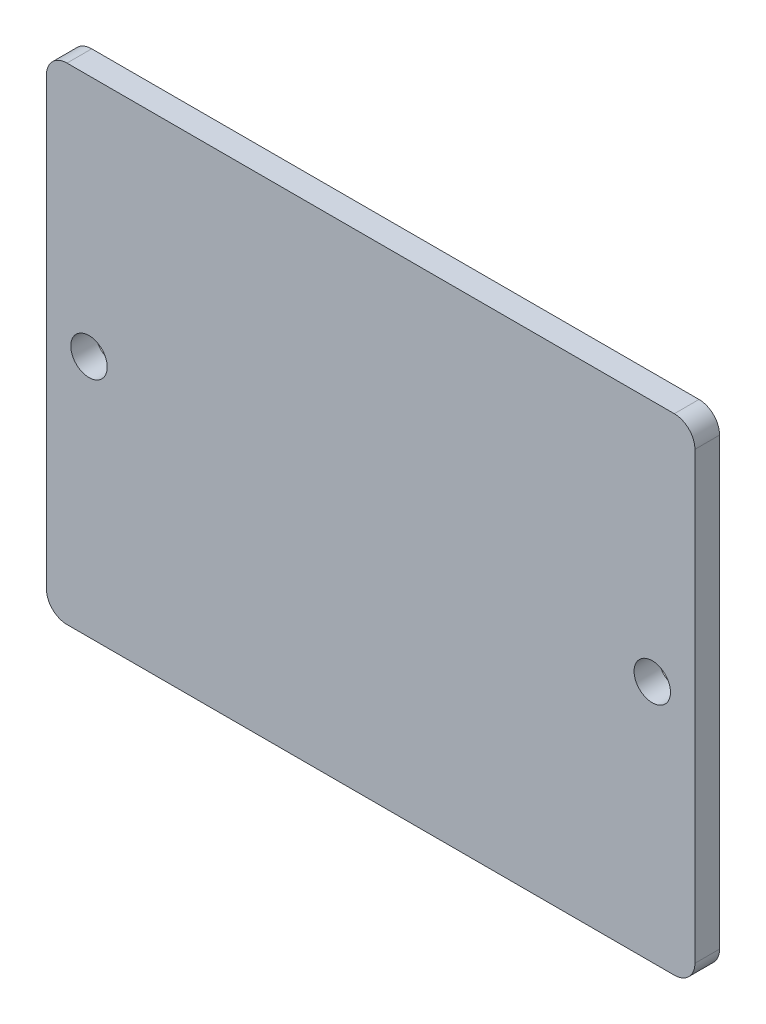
ISO-10303-21;
HEADER;
FILE_DESCRIPTION(('STEP AP214'),'2;1');
FILE_NAME('part.step','',(''),(''),'','','');
FILE_SCHEMA(('AUTOMOTIVE_DESIGN { 1 0 10303 214 1 1 1 1 }'));
ENDSEC;
DATA;
#1=APPLICATION_CONTEXT('core data for automotive mechanical design processes');
#2=APPLICATION_PROTOCOL_DEFINITION('international standard','automotive_design',2000,#1);
#3=PRODUCT_CONTEXT('',#1,'mechanical');
#4=PRODUCT('Part','Part','',(#3));
#5=PRODUCT_RELATED_PRODUCT_CATEGORY('part','',(#4));
#6=PRODUCT_DEFINITION_FORMATION('','',#4);
#7=PRODUCT_DEFINITION_CONTEXT('part definition',#1,'design');
#8=PRODUCT_DEFINITION('design','',#6,#7);
#9=PRODUCT_DEFINITION_SHAPE('','',#8);
#10=(LENGTH_UNIT() NAMED_UNIT(*) SI_UNIT(.MILLI.,.METRE.));
#11=(NAMED_UNIT(*) PLANE_ANGLE_UNIT() SI_UNIT($,.RADIAN.));
#12=(NAMED_UNIT(*) SI_UNIT($,.STERADIAN.) SOLID_ANGLE_UNIT());
#13=UNCERTAINTY_MEASURE_WITH_UNIT(LENGTH_MEASURE(1.E-05),#10,'distance_accuracy_value','');
#14=(GEOMETRIC_REPRESENTATION_CONTEXT(3) GLOBAL_UNCERTAINTY_ASSIGNED_CONTEXT((#13)) GLOBAL_UNIT_ASSIGNED_CONTEXT((#10,
#11,#12)) REPRESENTATION_CONTEXT('',''));
#15=CARTESIAN_POINT('',(0.,0.,0.));
#16=DIRECTION('',(0.,0.,1.));
#17=DIRECTION('',(1.,0.,0.));
#18=AXIS2_PLACEMENT_3D('',#15,#16,#17);
#19=CARTESIAN_POINT('',(-37.465,27.4573999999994,3.04800000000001));
#20=DIRECTION('',(0.,0.,-1.));
#21=DIRECTION('',(-1.,0.,0.));
#22=AXIS2_PLACEMENT_3D('',#19,#20,#21);
#23=CYLINDRICAL_SURFACE('',#22,2.54);
#24=CARTESIAN_POINT('',(-37.465,27.4573999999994,0.));
#25=DIRECTION('',(0.,0.,1.));
#26=DIRECTION('',(-1.,0.,0.));
#27=AXIS2_PLACEMENT_3D('',#24,#25,#26);
#28=CIRCLE('',#27,2.54);
#29=CARTESIAN_POINT('',(-37.465,29.9973999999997,0.));
#30=VERTEX_POINT('',#29);
#31=CARTESIAN_POINT('',(-40.005,27.4574,0.));
#32=VERTEX_POINT('',#31);
#33=EDGE_CURVE('E100',#30,#32,#28,.T.);
#34=ORIENTED_EDGE('',*,*,#33,.T.);
#35=DIRECTION('',(0.,0.,-1.));
#36=VECTOR('',#35,1.);
#37=CARTESIAN_POINT('',(-40.005,27.4574,3.048));
#38=LINE('',#37,#36);
#39=CARTESIAN_POINT('',(-40.005,27.4574,3.048));
#40=VERTEX_POINT('',#39);
#41=EDGE_CURVE('E11',#40,#32,#38,.T.);
#42=ORIENTED_EDGE('',*,*,#41,.F.);
#43=CARTESIAN_POINT('',(-37.465,27.4573999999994,3.04800000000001));
#44=DIRECTION('',(0.,0.,1.));
#45=DIRECTION('',(-1.,0.,0.));
#46=AXIS2_PLACEMENT_3D('',#43,#44,#45);
#47=CIRCLE('',#46,2.54);
#48=CARTESIAN_POINT('',(-37.465,29.9973999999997,3.048));
#49=VERTEX_POINT('',#48);
#50=EDGE_CURVE('E132',#49,#40,#47,.T.);
#51=ORIENTED_EDGE('',*,*,#50,.F.);
#52=DIRECTION('',(0.,0.,-1.));
#53=VECTOR('',#52,1.);
#54=CARTESIAN_POINT('',(-37.465,29.9973999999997,3.048));
#55=LINE('',#54,#53);
#56=EDGE_CURVE('E113',#49,#30,#55,.T.);
#57=ORIENTED_EDGE('',*,*,#56,.T.);
#58=EDGE_LOOP('',(#34,#42,#51,#57));
#59=FACE_BOUND('',#58,.T.);
#60=ADVANCED_FACE('F32',(#59),#23,.T.);
#61=CARTESIAN_POINT('',(-40.005,27.4574,3.048));
#62=DIRECTION('',(1.,0.,0.));
#63=DIRECTION('',(0.,1.,0.));
#64=AXIS2_PLACEMENT_3D('',#61,#62,#63);
#65=PLANE('',#64);
#66=DIRECTION('',(0.,-1.,0.));
#67=VECTOR('',#66,1.);
#68=CARTESIAN_POINT('',(-40.005,27.4574,0.));
#69=LINE('',#68,#67);
#70=CARTESIAN_POINT('',(-40.005,-27.4574,0.));
#71=VERTEX_POINT('',#70);
#72=EDGE_CURVE('E96',#32,#71,#69,.T.);
#73=ORIENTED_EDGE('',*,*,#72,.T.);
#74=DIRECTION('',(0.,0.,-1.));
#75=VECTOR('',#74,1.);
#76=CARTESIAN_POINT('',(-40.005,-27.4574,3.04799999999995));
#77=LINE('',#76,#75);
#78=CARTESIAN_POINT('',(-40.005,-27.4574,3.04799999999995));
#79=VERTEX_POINT('',#78);
#80=EDGE_CURVE('E39',#79,#71,#77,.T.);
#81=ORIENTED_EDGE('',*,*,#80,.F.);
#82=DIRECTION('',(0.,-1.,0.));
#83=VECTOR('',#82,1.);
#84=CARTESIAN_POINT('',(-40.005,27.4574,3.048));
#85=LINE('',#84,#83);
#86=EDGE_CURVE('E109',#40,#79,#85,.T.);
#87=ORIENTED_EDGE('',*,*,#86,.F.);
#88=ORIENTED_EDGE('',*,*,#41,.T.);
#89=EDGE_LOOP('',(#73,#81,#87,#88));
#90=FACE_BOUND('',#89,.T.);
#91=ADVANCED_FACE('F108',(#90),#65,.F.);
#92=CARTESIAN_POINT('',(-37.465,-27.4574,3.048));
#93=DIRECTION('',(0.,0.,-1.));
#94=DIRECTION('',(-1.,0.,0.));
#95=AXIS2_PLACEMENT_3D('',#92,#93,#94);
#96=CYLINDRICAL_SURFACE('',#95,2.54);
#97=CARTESIAN_POINT('',(-37.465,-27.4574,0.));
#98=DIRECTION('',(0.,0.,1.));
#99=DIRECTION('',(1.,0.,0.));
#100=AXIS2_PLACEMENT_3D('',#97,#98,#99);
#101=CIRCLE('',#100,2.54);
#102=CARTESIAN_POINT('',(-37.465,-29.9974,0.));
#103=VERTEX_POINT('',#102);
#104=EDGE_CURVE('E102',#71,#103,#101,.T.);
#105=ORIENTED_EDGE('',*,*,#104,.T.);
#106=DIRECTION('',(0.,0.,-1.));
#107=VECTOR('',#106,1.);
#108=CARTESIAN_POINT('',(-37.465,-29.9974000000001,3.04800000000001));
#109=LINE('',#108,#107);
#110=CARTESIAN_POINT('',(-37.465,-29.9974000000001,3.04800000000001));
#111=VERTEX_POINT('',#110);
#112=EDGE_CURVE('E158',#111,#103,#109,.T.);
#113=ORIENTED_EDGE('',*,*,#112,.F.);
#114=CARTESIAN_POINT('',(-37.465,-27.4574,3.048));
#115=DIRECTION('',(0.,0.,1.));
#116=DIRECTION('',(1.,0.,0.));
#117=AXIS2_PLACEMENT_3D('',#114,#115,#116);
#118=CIRCLE('',#117,2.54);
#119=EDGE_CURVE('E135',#79,#111,#118,.T.);
#120=ORIENTED_EDGE('',*,*,#119,.F.);
#121=ORIENTED_EDGE('',*,*,#80,.T.);
#122=EDGE_LOOP('',(#105,#113,#120,#121));
#123=FACE_BOUND('',#122,.T.);
#124=ADVANCED_FACE('F162',(#123),#96,.T.);
#125=CARTESIAN_POINT('',(-37.465,-29.9974000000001,3.04800000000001));
#126=DIRECTION('',(0.,1.,0.));
#127=DIRECTION('',(-1.,0.,0.));
#128=AXIS2_PLACEMENT_3D('',#125,#126,#127);
#129=PLANE('',#128);
#130=DIRECTION('',(1.,0.,0.));
#131=VECTOR('',#130,1.);
#132=CARTESIAN_POINT('',(-37.465,-29.9974,0.));
#133=LINE('',#132,#131);
#134=CARTESIAN_POINT('',(37.465,-29.9974000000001,0.));
#135=VERTEX_POINT('',#134);
#136=EDGE_CURVE('E122',#103,#135,#133,.T.);
#137=ORIENTED_EDGE('',*,*,#136,.T.);
#138=DIRECTION('',(0.,0.,-1.));
#139=VECTOR('',#138,1.);
#140=CARTESIAN_POINT('',(37.465,-29.9974000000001,3.04800000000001));
#141=LINE('',#140,#139);
#142=CARTESIAN_POINT('',(37.465,-29.9974000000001,3.04800000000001));
#143=VERTEX_POINT('',#142);
#144=EDGE_CURVE('E155',#143,#135,#141,.T.);
#145=ORIENTED_EDGE('',*,*,#144,.F.);
#146=DIRECTION('',(1.,0.,0.));
#147=VECTOR('',#146,1.);
#148=CARTESIAN_POINT('',(-37.465,-29.9974000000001,3.04800000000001));
#149=LINE('',#148,#147);
#150=EDGE_CURVE('E137',#111,#143,#149,.T.);
#151=ORIENTED_EDGE('',*,*,#150,.F.);
#152=ORIENTED_EDGE('',*,*,#112,.T.);
#153=EDGE_LOOP('',(#137,#145,#151,#152));
#154=FACE_BOUND('',#153,.T.);
#155=ADVANCED_FACE('F170',(#154),#129,.F.);
#156=CARTESIAN_POINT('',(37.4649999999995,-27.4574000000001,3.048));
#157=DIRECTION('',(0.,0.,-1.));
#158=DIRECTION('',(-1.,0.,0.));
#159=AXIS2_PLACEMENT_3D('',#156,#157,#158);
#160=CYLINDRICAL_SURFACE('',#159,2.54);
#161=CARTESIAN_POINT('',(37.4649999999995,-27.4574000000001,0.));
#162=DIRECTION('',(0.,0.,1.));
#163=DIRECTION('',(1.,0.,0.));
#164=AXIS2_PLACEMENT_3D('',#161,#162,#163);
#165=CIRCLE('',#164,2.54);
#166=CARTESIAN_POINT('',(40.0049999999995,-27.4574000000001,0.));
#167=VERTEX_POINT('',#166);
#168=EDGE_CURVE('E124',#135,#167,#165,.T.);
#169=ORIENTED_EDGE('',*,*,#168,.T.);
#170=DIRECTION('',(0.,0.,-1.));
#171=VECTOR('',#170,1.);
#172=CARTESIAN_POINT('',(40.0049999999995,-27.4574000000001,3.04800000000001));
#173=LINE('',#172,#171);
#174=CARTESIAN_POINT('',(40.0049999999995,-27.4574000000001,3.04800000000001));
#175=VERTEX_POINT('',#174);
#176=EDGE_CURVE('E152',#175,#167,#173,.T.);
#177=ORIENTED_EDGE('',*,*,#176,.F.);
#178=CARTESIAN_POINT('',(37.4649999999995,-27.4574000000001,3.048));
#179=DIRECTION('',(0.,0.,1.));
#180=DIRECTION('',(1.,0.,0.));
#181=AXIS2_PLACEMENT_3D('',#178,#179,#180);
#182=CIRCLE('',#181,2.54);
#183=EDGE_CURVE('E139',#143,#175,#182,.T.);
#184=ORIENTED_EDGE('',*,*,#183,.F.);
#185=ORIENTED_EDGE('',*,*,#144,.T.);
#186=EDGE_LOOP('',(#169,#177,#184,#185));
#187=FACE_BOUND('',#186,.T.);
#188=ADVANCED_FACE('F173',(#187),#160,.T.);
#189=CARTESIAN_POINT('',(40.005,27.4574,3.048));
#190=DIRECTION('',(-1.,0.,0.));
#191=DIRECTION('',(0.,-1.,0.));
#192=AXIS2_PLACEMENT_3D('',#189,#190,#191);
#193=PLANE('',#192);
#194=DIRECTION('',(0.,1.,0.));
#195=VECTOR('',#194,1.);
#196=CARTESIAN_POINT('',(40.005,27.4574,0.));
#197=LINE('',#196,#195);
#198=CARTESIAN_POINT('',(40.005,27.4574,0.));
#199=VERTEX_POINT('',#198);
#200=EDGE_CURVE('E126',#167,#199,#197,.T.);
#201=ORIENTED_EDGE('',*,*,#200,.T.);
#202=DIRECTION('',(0.,0.,-1.));
#203=VECTOR('',#202,1.);
#204=CARTESIAN_POINT('',(40.005,27.4574,3.048));
#205=LINE('',#204,#203);
#206=CARTESIAN_POINT('',(40.005,27.4574,3.048));
#207=VERTEX_POINT('',#206);
#208=EDGE_CURVE('E149',#207,#199,#205,.T.);
#209=ORIENTED_EDGE('',*,*,#208,.F.);
#210=DIRECTION('',(0.,1.,0.));
#211=VECTOR('',#210,1.);
#212=CARTESIAN_POINT('',(40.005,27.4574,3.048));
#213=LINE('',#212,#211);
#214=EDGE_CURVE('E141',#175,#207,#213,.T.);
#215=ORIENTED_EDGE('',*,*,#214,.F.);
#216=ORIENTED_EDGE('',*,*,#176,.T.);
#217=EDGE_LOOP('',(#201,#209,#215,#216));
#218=FACE_BOUND('',#217,.T.);
#219=ADVANCED_FACE('F178',(#218),#193,.F.);
#220=CARTESIAN_POINT('',(37.465,27.4574,3.04799999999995));
#221=DIRECTION('',(0.,0.,-1.));
#222=DIRECTION('',(-1.,0.,0.));
#223=AXIS2_PLACEMENT_3D('',#220,#221,#222);
#224=CYLINDRICAL_SURFACE('',#223,2.54);
#225=CARTESIAN_POINT('',(37.465,27.4574,0.));
#226=DIRECTION('',(0.,0.,1.));
#227=DIRECTION('',(1.,0.,0.));
#228=AXIS2_PLACEMENT_3D('',#225,#226,#227);
#229=CIRCLE('',#228,2.54);
#230=CARTESIAN_POINT('',(37.465,29.9974,0.));
#231=VERTEX_POINT('',#230);
#232=EDGE_CURVE('E128',#199,#231,#229,.T.);
#233=ORIENTED_EDGE('',*,*,#232,.T.);
#234=DIRECTION('',(0.,0.,-1.));
#235=VECTOR('',#234,1.);
#236=CARTESIAN_POINT('',(37.465,29.9974,3.048));
#237=LINE('',#236,#235);
#238=CARTESIAN_POINT('',(37.465,29.9974,3.048));
#239=VERTEX_POINT('',#238);
#240=EDGE_CURVE('E146',#239,#231,#237,.T.);
#241=ORIENTED_EDGE('',*,*,#240,.F.);
#242=CARTESIAN_POINT('',(37.465,27.4574,3.04799999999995));
#243=DIRECTION('',(0.,0.,1.));
#244=DIRECTION('',(1.,0.,0.));
#245=AXIS2_PLACEMENT_3D('',#242,#243,#244);
#246=CIRCLE('',#245,2.54);
#247=EDGE_CURVE('E51',#207,#239,#246,.T.);
#248=ORIENTED_EDGE('',*,*,#247,.F.);
#249=ORIENTED_EDGE('',*,*,#208,.T.);
#250=EDGE_LOOP('',(#233,#241,#248,#249));
#251=FACE_BOUND('',#250,.T.);
#252=ADVANCED_FACE('F181',(#251),#224,.T.);
#253=CARTESIAN_POINT('',(-37.465,29.9973999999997,3.048));
#254=DIRECTION('',(0.,-1.,0.));
#255=DIRECTION('',(0.,0.,-1.));
#256=AXIS2_PLACEMENT_3D('',#253,#254,#255);
#257=PLANE('',#256);
#258=DIRECTION('',(-1.,0.,0.));
#259=VECTOR('',#258,1.);
#260=CARTESIAN_POINT('',(-37.465,29.9973999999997,0.));
#261=LINE('',#260,#259);
#262=EDGE_CURVE('E130',#231,#30,#261,.T.);
#263=ORIENTED_EDGE('',*,*,#262,.T.);
#264=ORIENTED_EDGE('',*,*,#56,.F.);
#265=DIRECTION('',(-1.,0.,0.));
#266=VECTOR('',#265,1.);
#267=CARTESIAN_POINT('',(-37.465,29.9973999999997,3.048));
#268=LINE('',#267,#266);
#269=EDGE_CURVE('E46',#239,#49,#268,.T.);
#270=ORIENTED_EDGE('',*,*,#269,.F.);
#271=ORIENTED_EDGE('',*,*,#240,.T.);
#272=EDGE_LOOP('',(#263,#264,#270,#271));
#273=FACE_BOUND('',#272,.T.);
#274=ADVANCED_FACE('F183',(#273),#257,.F.);
#275=CARTESIAN_POINT('',(-37.465,27.4573999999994,3.04800000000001));
#276=DIRECTION('',(0.,0.,-1.));
#277=DIRECTION('',(-1.,0.,0.));
#278=AXIS2_PLACEMENT_3D('',#275,#276,#277);
#279=PLANE('',#278);
#280=CARTESIAN_POINT('',(34.7472,0.,3.04800000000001));
#281=DIRECTION('',(0.,0.,1.));
#282=DIRECTION('',(-1.,0.,0.));
#283=AXIS2_PLACEMENT_3D('',#280,#281,#282);
#284=CIRCLE('',#283,2.2479);
#285=CARTESIAN_POINT('',(32.4993,0.,3.04800000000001));
#286=VERTEX_POINT('',#285);
#287=EDGE_CURVE('E265',#286,#286,#284,.T.);
#288=ORIENTED_EDGE('',*,*,#287,.F.);
#289=EDGE_LOOP('',(#288));
#290=FACE_BOUND('',#289,.T.);
#291=CARTESIAN_POINT('',(-34.7472,0.,3.048));
#292=DIRECTION('',(0.,0.,1.));
#293=DIRECTION('',(1.,0.,0.));
#294=AXIS2_PLACEMENT_3D('',#291,#292,#293);
#295=CIRCLE('',#294,2.2479);
#296=CARTESIAN_POINT('',(-32.4993,0.,3.048));
#297=VERTEX_POINT('',#296);
#298=EDGE_CURVE('E114',#297,#297,#295,.T.);
#299=ORIENTED_EDGE('',*,*,#298,.F.);
#300=EDGE_LOOP('',(#299));
#301=FACE_BOUND('',#300,.T.);
#302=ORIENTED_EDGE('',*,*,#50,.T.);
#303=ORIENTED_EDGE('',*,*,#86,.T.);
#304=ORIENTED_EDGE('',*,*,#119,.T.);
#305=ORIENTED_EDGE('',*,*,#150,.T.);
#306=ORIENTED_EDGE('',*,*,#183,.T.);
#307=ORIENTED_EDGE('',*,*,#214,.T.);
#308=ORIENTED_EDGE('',*,*,#247,.T.);
#309=ORIENTED_EDGE('',*,*,#269,.T.);
#310=EDGE_LOOP('',(#302,#303,#304,#305,#306,#307,#308,#309));
#311=FACE_BOUND('',#310,.T.);
#312=ADVANCED_FACE('F165',(#290,#301,#311),#279,.F.);
#313=CARTESIAN_POINT('',(-37.465,27.4573999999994,0.));
#314=DIRECTION('',(0.,0.,-1.));
#315=DIRECTION('',(-1.,0.,0.));
#316=AXIS2_PLACEMENT_3D('',#313,#314,#315);
#317=PLANE('',#316);
#318=CARTESIAN_POINT('',(34.7472,0.,0.));
#319=DIRECTION('',(0.,0.,-1.));
#320=DIRECTION('',(-1.,0.,0.));
#321=AXIS2_PLACEMENT_3D('',#318,#319,#320);
#322=CIRCLE('',#321,2.2479);
#323=CARTESIAN_POINT('',(32.4993,0.,0.));
#324=VERTEX_POINT('',#323);
#325=EDGE_CURVE('E262',#324,#324,#322,.F.);
#326=ORIENTED_EDGE('',*,*,#325,.T.);
#327=EDGE_LOOP('',(#326));
#328=FACE_BOUND('',#327,.T.);
#329=CARTESIAN_POINT('',(-34.7472,0.,0.));
#330=DIRECTION('',(0.,0.,-1.));
#331=DIRECTION('',(-1.,0.,0.));
#332=AXIS2_PLACEMENT_3D('',#329,#330,#331);
#333=CIRCLE('',#332,2.2479);
#334=CARTESIAN_POINT('',(-36.9951,0.,0.));
#335=VERTEX_POINT('',#334);
#336=EDGE_CURVE('E117',#335,#335,#333,.F.);
#337=ORIENTED_EDGE('',*,*,#336,.T.);
#338=EDGE_LOOP('',(#337));
#339=FACE_BOUND('',#338,.T.);
#340=ORIENTED_EDGE('',*,*,#33,.F.);
#341=ORIENTED_EDGE('',*,*,#262,.F.);
#342=ORIENTED_EDGE('',*,*,#232,.F.);
#343=ORIENTED_EDGE('',*,*,#200,.F.);
#344=ORIENTED_EDGE('',*,*,#168,.F.);
#345=ORIENTED_EDGE('',*,*,#136,.F.);
#346=ORIENTED_EDGE('',*,*,#104,.F.);
#347=ORIENTED_EDGE('',*,*,#72,.F.);
#348=EDGE_LOOP('',(#340,#341,#342,#343,#344,#345,#346,#347));
#349=FACE_BOUND('',#348,.T.);
#350=ADVANCED_FACE('F97',(#328,#339,#349),#317,.T.);
#351=CARTESIAN_POINT('',(-34.7472,0.,-0.001000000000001));
#352=DIRECTION('',(0.,0.,1.));
#353=DIRECTION('',(1.,0.,0.));
#354=AXIS2_PLACEMENT_3D('',#351,#352,#353);
#355=CYLINDRICAL_SURFACE('',#354,2.2479);
#356=ORIENTED_EDGE('',*,*,#336,.F.);
#357=EDGE_LOOP('',(#356));
#358=FACE_BOUND('',#357,.T.);
#359=ORIENTED_EDGE('',*,*,#298,.T.);
#360=EDGE_LOOP('',(#359));
#361=FACE_BOUND('',#360,.T.);
#362=ADVANCED_FACE('F235',(#358,#361),#355,.F.);
#363=CARTESIAN_POINT('',(34.7472,0.,-0.001000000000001));
#364=DIRECTION('',(0.,0.,1.));
#365=DIRECTION('',(1.,0.,0.));
#366=AXIS2_PLACEMENT_3D('',#363,#364,#365);
#367=CYLINDRICAL_SURFACE('',#366,2.2479);
#368=ORIENTED_EDGE('',*,*,#325,.F.);
#369=EDGE_LOOP('',(#368));
#370=FACE_BOUND('',#369,.T.);
#371=ORIENTED_EDGE('',*,*,#287,.T.);
#372=EDGE_LOOP('',(#371));
#373=FACE_BOUND('',#372,.T.);
#374=ADVANCED_FACE('F245',(#370,#373),#367,.F.);
#375=CLOSED_SHELL('',(#60,#91,#124,#155,#188,#219,#252,#274,#312,#350,#362,#374));
#376=MANIFOLD_SOLID_BREP('B2',#375);
#377=ADVANCED_BREP_SHAPE_REPRESENTATION('',(#18,#376),#14);
#378=SHAPE_DEFINITION_REPRESENTATION(#9,#377);
ENDSEC;
END-ISO-10303-21;
